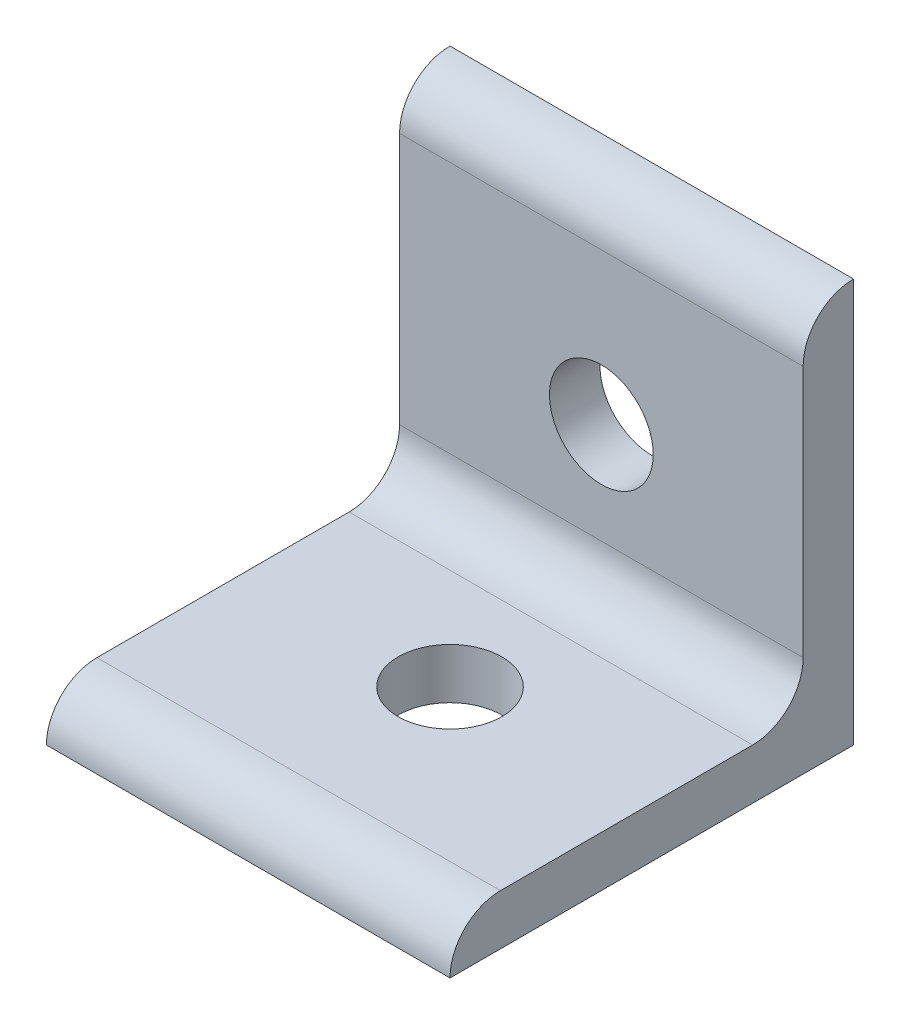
from build123d import *

# Parameters (mm, degrees)
BOSS_EXTRUDE1_DEPTH      = 12.7
BOSS_EXTRUDE1_DEPTH_BACK = 12.7
SKETCH2_R                = 3.2639
CUT_EXTRUDE1_DEPTH       = 3.175
SKETCH3_R                = 3.2639
CUT_EXTRUDE2_DEPTH       = 3.175


with BuildPart() as part:
    # Sketch1 → Boss-Extrude1 (new, two sides: drawn at the far end of the back side and taken through both)
    with BuildSketch(Plane(origin=(0, 0, 0), x_dir=(0, 0, -1), z_dir=(1, 0, 0)).offset(-BOSS_EXTRUDE1_DEPTH_BACK)):
        with BuildLine():
            Line((-25.4, 0), (0, 0))
            Line((0, 0), (0, 25.4))
            ThreePointArc((0, 25.4), (-2.24506403, 24.47006403), (-3.175, 22.225))
            Line((-3.175, 22.225), (-3.175, 6.35))
            ThreePointArc((-3.175, 6.35), (-4.10493597, 4.10493597), (-6.35, 3.175))
            Line((-6.35, 3.175), (-22.225, 3.175))
            ThreePointArc((-22.225, 3.175), (-24.47006403, 2.24506403), (-25.4, 0))
        make_face()
    extrude(amount=BOSS_EXTRUDE1_DEPTH + BOSS_EXTRUDE1_DEPTH_BACK)

    # Sketch2 → Cut-Extrude1 (cut)
    with BuildSketch(Plane.XY):
        with Locations((0, 12.7)):
            Circle(SKETCH2_R)
    extrude(amount=CUT_EXTRUDE1_DEPTH, mode=Mode.SUBTRACT)

    # Sketch3 → Cut-Extrude2 (cut)
    with BuildSketch(Plane(origin=(0, 0, 0), x_dir=(1, 0, 0), z_dir=(0, 1, 0))):
        with Locations(Location((0, -12.7, 0), (0, 0, 270))):
            Circle(SKETCH3_R)
    extrude(amount=CUT_EXTRUDE2_DEPTH, mode=Mode.SUBTRACT)


solid = part.part
